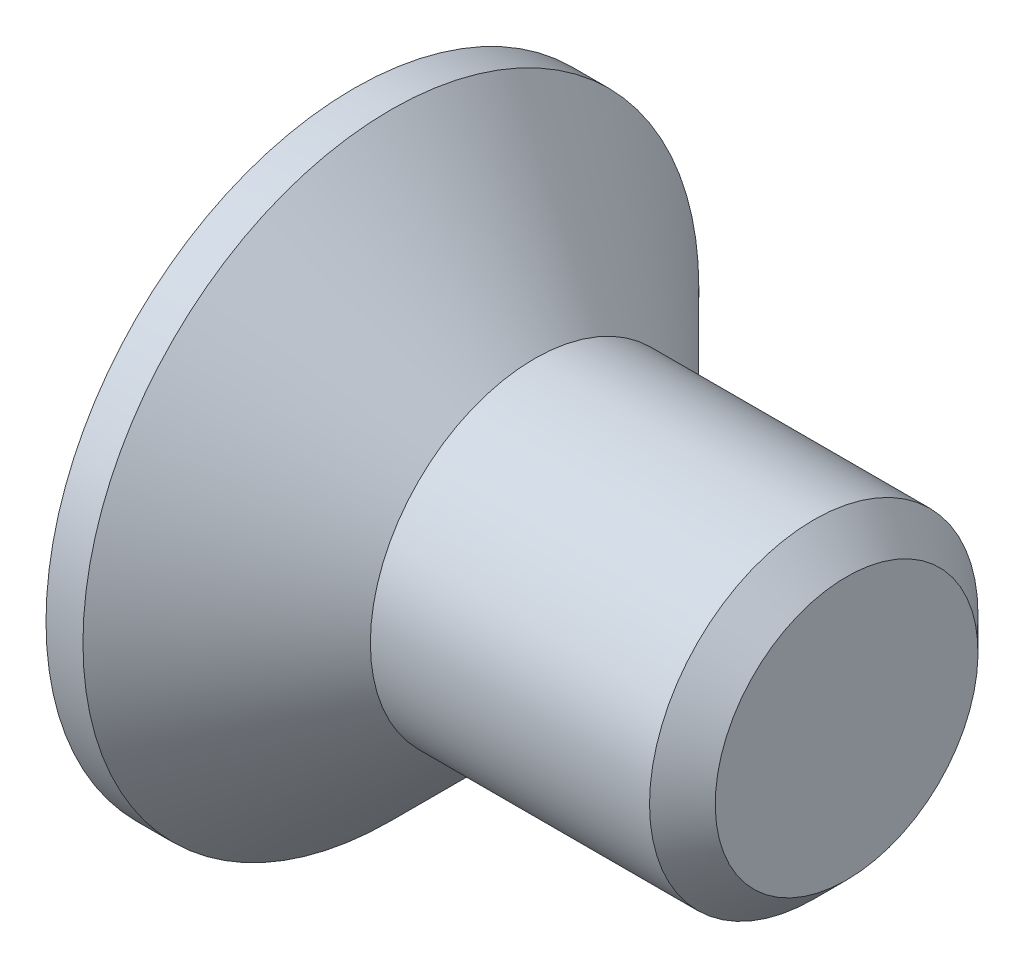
from build123d import *

# Parameters (mm, degrees)
CHAMFER1_SIZE      = 0.4
CUT_EXTRUDE1_DEPTH = 1.9


with BuildPart() as part:
    # Sketch1 → Revolve1 (revolve)
    with BuildSketch(Plane.XY, mode=Mode.PRIVATE) as revolve1_sk:
        Polygon((-2.2, 3.75), (-2.2, 0), (3.8, 0), (3.8, 2), (0, 2), (-1.75, 3.75), align=None)
    revolve(revolve1_sk.sketch.rotate(Axis((-2.2, 0, 0), (1, 0, 0)), 180), axis=Axis((-2.2, 0, 0), (1, 0, 0)))

    # Chamfer1
    chamfer1_edges = [part.edges().sort_by_distance(p)[0] for p in [
        (3.8, 2, 0),
    ]]
    chamfer(chamfer1_edges, length=CHAMFER1_SIZE)

    # Sketch2 → Cut-Extrude1 (cut)
    with BuildSketch(Plane.ZY.offset(2.2)):
        Polygon((-0.55, 2.2), (0.55, 2.2), (0.55, 0.55), (2.2, 0.55), (2.2, -0.55), (0.55, -0.55), (0.55, -2.2), (-0.55, -2.2), (-0.55, -0.55), (-2.2, -0.55), (-2.2, 0.55), (-0.55, 0.55), align=None)
    extrude(amount=-CUT_EXTRUDE1_DEPTH, mode=Mode.SUBTRACT)


solid = part.part
